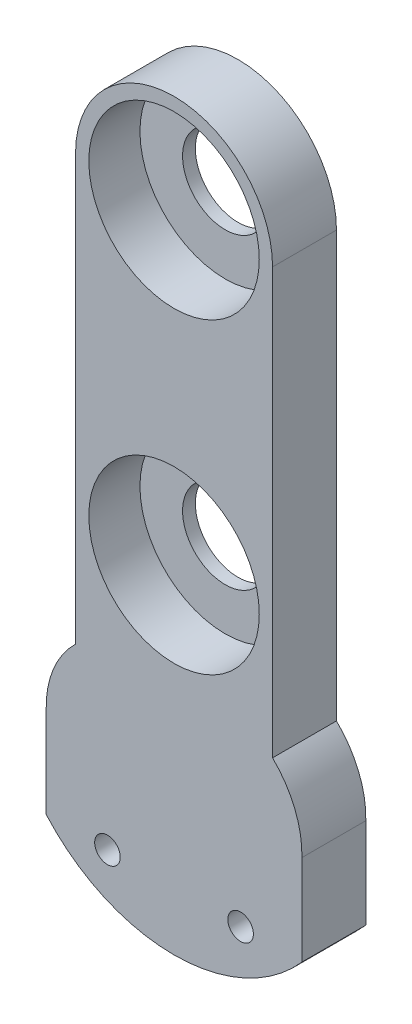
ISO-10303-21;
HEADER;
FILE_DESCRIPTION(('STEP AP214'),'2;1');
FILE_NAME('part.step','',(''),(''),'','','');
FILE_SCHEMA(('AUTOMOTIVE_DESIGN { 1 0 10303 214 1 1 1 1 }'));
ENDSEC;
DATA;
#1=APPLICATION_CONTEXT('core data for automotive mechanical design processes');
#2=APPLICATION_PROTOCOL_DEFINITION('international standard','automotive_design',2000,#1);
#3=PRODUCT_CONTEXT('',#1,'mechanical');
#4=PRODUCT('Part','Part','',(#3));
#5=PRODUCT_RELATED_PRODUCT_CATEGORY('part','',(#4));
#6=PRODUCT_DEFINITION_FORMATION('','',#4);
#7=PRODUCT_DEFINITION_CONTEXT('part definition',#1,'design');
#8=PRODUCT_DEFINITION('design','',#6,#7);
#9=PRODUCT_DEFINITION_SHAPE('','',#8);
#10=(LENGTH_UNIT() NAMED_UNIT(*) SI_UNIT(.MILLI.,.METRE.));
#11=(NAMED_UNIT(*) PLANE_ANGLE_UNIT() SI_UNIT($,.RADIAN.));
#12=(NAMED_UNIT(*) SI_UNIT($,.STERADIAN.) SOLID_ANGLE_UNIT());
#13=UNCERTAINTY_MEASURE_WITH_UNIT(LENGTH_MEASURE(1.E-05),#10,'distance_accuracy_value','');
#14=(GEOMETRIC_REPRESENTATION_CONTEXT(3) GLOBAL_UNCERTAINTY_ASSIGNED_CONTEXT((#13)) GLOBAL_UNIT_ASSIGNED_CONTEXT((#10,
#11,#12)) REPRESENTATION_CONTEXT('',''));
#15=CARTESIAN_POINT('',(0.,0.,0.));
#16=DIRECTION('',(0.,0.,1.));
#17=DIRECTION('',(1.,0.,0.));
#18=AXIS2_PLACEMENT_3D('',#15,#16,#17);
#19=CARTESIAN_POINT('',(22.6350916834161,21.7990207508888,15.));
#20=DIRECTION('',(0.,0.,-1.));
#21=DIRECTION('',(-1.,0.,0.));
#22=AXIS2_PLACEMENT_3D('',#19,#20,#21);
#23=PLANE('',#22);
#24=CARTESIAN_POINT('',(30.,137.820795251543,15.));
#25=DIRECTION('',(0.,0.,1.));
#26=DIRECTION('',(1.,0.,0.));
#27=AXIS2_PLACEMENT_3D('',#24,#25,#26);
#28=CIRCLE('',#27,20.);
#29=CARTESIAN_POINT('',(50.,137.820795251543,15.));
#30=VERTEX_POINT('',#29);
#31=EDGE_CURVE('E279',#30,#30,#28,.T.);
#32=ORIENTED_EDGE('',*,*,#31,.F.);
#33=EDGE_LOOP('',(#32));
#34=FACE_BOUND('',#33,.T.);
#35=CARTESIAN_POINT('',(30.,65.7007952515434,15.));
#36=DIRECTION('',(0.,0.,1.));
#37=DIRECTION('',(1.,0.,0.));
#38=AXIS2_PLACEMENT_3D('',#35,#36,#37);
#39=CIRCLE('',#38,20.);
#40=CARTESIAN_POINT('',(50.,65.7007952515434,15.));
#41=VERTEX_POINT('',#40);
#42=EDGE_CURVE('E283',#41,#41,#39,.T.);
#43=ORIENTED_EDGE('',*,*,#42,.F.);
#44=EDGE_LOOP('',(#43));
#45=FACE_BOUND('',#44,.T.);
#46=CARTESIAN_POINT('',(45.625,0.,15.));
#47=DIRECTION('',(0.,0.,-1.));
#48=DIRECTION('',(-1.,0.,0.));
#49=AXIS2_PLACEMENT_3D('',#46,#47,#48);
#50=CIRCLE('',#49,3.);
#51=CARTESIAN_POINT('',(42.625,0.,15.));
#52=VERTEX_POINT('',#51);
#53=EDGE_CURVE('E290',#52,#52,#50,.T.);
#54=ORIENTED_EDGE('',*,*,#53,.T.);
#55=EDGE_LOOP('',(#54));
#56=FACE_BOUND('',#55,.T.);
#57=DIRECTION('',(0.,-1.,0.));
#58=VECTOR('',#57,1.);
#59=CARTESIAN_POINT('',(6.88547195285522,137.820795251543,15.));
#60=LINE('',#59,#58);
#61=CARTESIAN_POINT('',(6.88547195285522,137.820795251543,15.));
#62=VERTEX_POINT('',#61);
#63=CARTESIAN_POINT('',(6.88547195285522,38.0660252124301,15.));
#64=VERTEX_POINT('',#63);
#65=EDGE_CURVE('E172',#62,#64,#60,.T.);
#66=ORIENTED_EDGE('',*,*,#65,.T.);
#67=CARTESIAN_POINT('',(22.6350916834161,21.7990207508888,15.));
#68=DIRECTION('',(0.,0.,-1.));
#69=DIRECTION('',(-1.,0.,0.));
#70=AXIS2_PLACEMENT_3D('',#67,#68,#69);
#71=CIRCLE('',#70,22.642127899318);
#72=CARTESIAN_POINT('',(0.,21.2345915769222,15.));
#73=VERTEX_POINT('',#72);
#74=EDGE_CURVE('E306',#73,#64,#71,.T.);
#75=ORIENTED_EDGE('',*,*,#74,.F.);
#76=DIRECTION('',(0.,1.,0.));
#77=VECTOR('',#76,1.);
#78=CARTESIAN_POINT('',(0.,0.,15.));
#79=LINE('',#78,#77);
#80=CARTESIAN_POINT('',(0.,0.,15.));
#81=VERTEX_POINT('',#80);
#82=EDGE_CURVE('E310',#81,#73,#79,.T.);
#83=ORIENTED_EDGE('',*,*,#82,.F.);
#84=CARTESIAN_POINT('',(30.,26.4575131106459,15.));
#85=DIRECTION('',(0.,0.,1.));
#86=DIRECTION('',(1.,0.,0.));
#87=AXIS2_PLACEMENT_3D('',#84,#85,#86);
#88=CIRCLE('',#87,40.);
#89=CARTESIAN_POINT('',(60.,0.,15.));
#90=VERTEX_POINT('',#89);
#91=EDGE_CURVE('E314',#81,#90,#88,.T.);
#92=ORIENTED_EDGE('',*,*,#91,.T.);
#93=DIRECTION('',(0.,1.,0.));
#94=VECTOR('',#93,1.);
#95=CARTESIAN_POINT('',(60.,0.,15.));
#96=LINE('',#95,#94);
#97=CARTESIAN_POINT('',(60.,21.2345915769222,15.));
#98=VERTEX_POINT('',#97);
#99=EDGE_CURVE('E193',#90,#98,#96,.T.);
#100=ORIENTED_EDGE('',*,*,#99,.T.);
#101=CARTESIAN_POINT('',(37.364908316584,21.7990207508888,15.));
#102=DIRECTION('',(0.,0.,1.));
#103=DIRECTION('',(1.,0.,0.));
#104=AXIS2_PLACEMENT_3D('',#101,#102,#103);
#105=CIRCLE('',#104,22.642127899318);
#106=CARTESIAN_POINT('',(53.1145280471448,38.0660252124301,15.));
#107=VERTEX_POINT('',#106);
#108=EDGE_CURVE('E187',#98,#107,#105,.T.);
#109=ORIENTED_EDGE('',*,*,#108,.T.);
#110=DIRECTION('',(0.,1.,0.));
#111=VECTOR('',#110,1.);
#112=CARTESIAN_POINT('',(53.1145280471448,38.0660252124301,15.));
#113=LINE('',#112,#111);
#114=CARTESIAN_POINT('',(53.1145280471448,137.820795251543,15.));
#115=VERTEX_POINT('',#114);
#116=EDGE_CURVE('E191',#107,#115,#113,.T.);
#117=ORIENTED_EDGE('',*,*,#116,.T.);
#118=CARTESIAN_POINT('',(30.,137.820795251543,15.));
#119=DIRECTION('',(0.,0.,-1.));
#120=DIRECTION('',(-1.,0.,0.));
#121=AXIS2_PLACEMENT_3D('',#118,#119,#120);
#122=CIRCLE('',#121,23.1145280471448);
#123=EDGE_CURVE('E211',#62,#115,#122,.T.);
#124=ORIENTED_EDGE('',*,*,#123,.F.);
#125=EDGE_LOOP('',(#66,#75,#83,#92,#100,#109,#117,#124));
#126=FACE_BOUND('',#125,.T.);
#127=CARTESIAN_POINT('',(14.375,0.,15.));
#128=DIRECTION('',(0.,0.,1.));
#129=DIRECTION('',(1.,0.,0.));
#130=AXIS2_PLACEMENT_3D('',#127,#128,#129);
#131=CIRCLE('',#130,3.);
#132=CARTESIAN_POINT('',(17.375,0.,15.));
#133=VERTEX_POINT('',#132);
#134=EDGE_CURVE('E220',#133,#133,#131,.T.);
#135=ORIENTED_EDGE('',*,*,#134,.F.);
#136=EDGE_LOOP('',(#135));
#137=FACE_BOUND('',#136,.T.);
#138=ADVANCED_FACE('F111',(#34,#45,#56,#126,#137),#23,.F.);
#139=CARTESIAN_POINT('',(22.6350916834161,21.7990207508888,0.));
#140=DIRECTION('',(0.,0.,-1.));
#141=DIRECTION('',(-1.,0.,0.));
#142=AXIS2_PLACEMENT_3D('',#139,#140,#141);
#143=PLANE('',#142);
#144=CARTESIAN_POINT('',(30.,137.820795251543,0.));
#145=DIRECTION('',(0.,0.,1.));
#146=DIRECTION('',(1.,0.,0.));
#147=AXIS2_PLACEMENT_3D('',#144,#145,#146);
#148=CIRCLE('',#147,10.);
#149=CARTESIAN_POINT('',(40.,137.820795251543,0.));
#150=VERTEX_POINT('',#149);
#151=EDGE_CURVE('E258',#150,#150,#148,.T.);
#152=ORIENTED_EDGE('',*,*,#151,.T.);
#153=EDGE_LOOP('',(#152));
#154=FACE_BOUND('',#153,.T.);
#155=CARTESIAN_POINT('',(30.,65.7007952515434,0.));
#156=DIRECTION('',(0.,0.,1.));
#157=DIRECTION('',(1.,0.,0.));
#158=AXIS2_PLACEMENT_3D('',#155,#156,#157);
#159=CIRCLE('',#158,10.);
#160=CARTESIAN_POINT('',(40.,65.7007952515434,0.));
#161=VERTEX_POINT('',#160);
#162=EDGE_CURVE('E266',#161,#161,#159,.T.);
#163=ORIENTED_EDGE('',*,*,#162,.T.);
#164=EDGE_LOOP('',(#163));
#165=FACE_BOUND('',#164,.T.);
#166=CARTESIAN_POINT('',(45.625,0.,0.));
#167=DIRECTION('',(0.,0.,-1.));
#168=DIRECTION('',(-1.,0.,0.));
#169=AXIS2_PLACEMENT_3D('',#166,#167,#168);
#170=CIRCLE('',#169,3.);
#171=CARTESIAN_POINT('',(42.625,0.,0.));
#172=VERTEX_POINT('',#171);
#173=EDGE_CURVE('E278',#172,#172,#170,.T.);
#174=ORIENTED_EDGE('',*,*,#173,.F.);
#175=EDGE_LOOP('',(#174));
#176=FACE_BOUND('',#175,.T.);
#177=DIRECTION('',(0.,-1.,0.));
#178=VECTOR('',#177,1.);
#179=CARTESIAN_POINT('',(6.88547195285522,115.557729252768,0.));
#180=LINE('',#179,#178);
#181=CARTESIAN_POINT('',(6.88547195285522,137.820795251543,0.));
#182=VERTEX_POINT('',#181);
#183=CARTESIAN_POINT('',(6.88547195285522,38.0660252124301,0.));
#184=VERTEX_POINT('',#183);
#185=EDGE_CURVE('E165',#182,#184,#180,.T.);
#186=ORIENTED_EDGE('',*,*,#185,.F.);
#187=CARTESIAN_POINT('',(30.,137.820795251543,0.));
#188=DIRECTION('',(0.,0.,-1.));
#189=DIRECTION('',(-1.,0.,0.));
#190=AXIS2_PLACEMENT_3D('',#187,#188,#189);
#191=CIRCLE('',#190,23.1145280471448);
#192=CARTESIAN_POINT('',(53.1145280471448,137.820795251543,0.));
#193=VERTEX_POINT('',#192);
#194=EDGE_CURVE('E238',#182,#193,#191,.T.);
#195=ORIENTED_EDGE('',*,*,#194,.T.);
#196=DIRECTION('',(0.,1.,0.));
#197=VECTOR('',#196,1.);
#198=CARTESIAN_POINT('',(53.1145280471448,115.557729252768,0.));
#199=LINE('',#198,#197);
#200=CARTESIAN_POINT('',(53.1145280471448,38.0660252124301,0.));
#201=VERTEX_POINT('',#200);
#202=EDGE_CURVE('E235',#201,#193,#199,.T.);
#203=ORIENTED_EDGE('',*,*,#202,.F.);
#204=CARTESIAN_POINT('',(37.364908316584,21.7990207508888,0.));
#205=DIRECTION('',(0.,0.,1.));
#206=DIRECTION('',(1.,0.,0.));
#207=AXIS2_PLACEMENT_3D('',#204,#205,#206);
#208=CIRCLE('',#207,22.642127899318);
#209=CARTESIAN_POINT('',(60.,21.2345915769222,0.));
#210=VERTEX_POINT('',#209);
#211=EDGE_CURVE('E204',#210,#201,#208,.T.);
#212=ORIENTED_EDGE('',*,*,#211,.F.);
#213=DIRECTION('',(0.,1.,0.));
#214=VECTOR('',#213,1.);
#215=CARTESIAN_POINT('',(60.,0.,0.));
#216=LINE('',#215,#214);
#217=CARTESIAN_POINT('',(60.,0.,0.));
#218=VERTEX_POINT('',#217);
#219=EDGE_CURVE('E230',#218,#210,#216,.T.);
#220=ORIENTED_EDGE('',*,*,#219,.F.);
#221=CARTESIAN_POINT('',(30.,26.4575131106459,0.));
#222=DIRECTION('',(0.,0.,1.));
#223=DIRECTION('',(1.,0.,0.));
#224=AXIS2_PLACEMENT_3D('',#221,#222,#223);
#225=CIRCLE('',#224,40.);
#226=CARTESIAN_POINT('',(0.,0.,0.));
#227=VERTEX_POINT('',#226);
#228=EDGE_CURVE('E227',#227,#218,#225,.T.);
#229=ORIENTED_EDGE('',*,*,#228,.F.);
#230=DIRECTION('',(0.,1.,0.));
#231=VECTOR('',#230,1.);
#232=CARTESIAN_POINT('',(0.,0.,0.));
#233=LINE('',#232,#231);
#234=CARTESIAN_POINT('',(0.,21.2345915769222,0.));
#235=VERTEX_POINT('',#234);
#236=EDGE_CURVE('E223',#227,#235,#233,.T.);
#237=ORIENTED_EDGE('',*,*,#236,.T.);
#238=CARTESIAN_POINT('',(22.6350916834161,21.7990207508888,0.));
#239=DIRECTION('',(0.,0.,-1.));
#240=DIRECTION('',(-1.,0.,0.));
#241=AXIS2_PLACEMENT_3D('',#238,#239,#240);
#242=CIRCLE('',#241,22.642127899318);
#243=EDGE_CURVE('E219',#235,#184,#242,.T.);
#244=ORIENTED_EDGE('',*,*,#243,.T.);
#245=EDGE_LOOP('',(#186,#195,#203,#212,#220,#229,#237,#244));
#246=FACE_BOUND('',#245,.T.);
#247=CARTESIAN_POINT('',(14.375,0.,0.));
#248=DIRECTION('',(0.,0.,1.));
#249=DIRECTION('',(1.,0.,0.));
#250=AXIS2_PLACEMENT_3D('',#247,#248,#249);
#251=CIRCLE('',#250,3.);
#252=CARTESIAN_POINT('',(17.375,0.,0.));
#253=VERTEX_POINT('',#252);
#254=EDGE_CURVE('E294',#253,#253,#251,.T.);
#255=ORIENTED_EDGE('',*,*,#254,.T.);
#256=EDGE_LOOP('',(#255));
#257=FACE_BOUND('',#256,.T.);
#258=ADVANCED_FACE('F326',(#154,#165,#176,#246,#257),#143,.T.);
#259=CARTESIAN_POINT('',(6.88547195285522,115.557729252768,15.));
#260=DIRECTION('',(1.,0.,0.));
#261=DIRECTION('',(0.,0.,-1.));
#262=AXIS2_PLACEMENT_3D('',#259,#260,#261);
#263=PLANE('',#262);
#264=ORIENTED_EDGE('',*,*,#185,.T.);
#265=DIRECTION('',(0.,0.,-1.));
#266=VECTOR('',#265,1.);
#267=CARTESIAN_POINT('',(6.88547195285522,38.0660252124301,15.));
#268=LINE('',#267,#266);
#269=EDGE_CURVE('E12',#64,#184,#268,.T.);
#270=ORIENTED_EDGE('',*,*,#269,.F.);
#271=ORIENTED_EDGE('',*,*,#65,.F.);
#272=DIRECTION('',(0.,0.,-1.));
#273=VECTOR('',#272,1.);
#274=CARTESIAN_POINT('',(6.88547195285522,137.820795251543,15.));
#275=LINE('',#274,#273);
#276=EDGE_CURVE('E131',#62,#182,#275,.T.);
#277=ORIENTED_EDGE('',*,*,#276,.T.);
#278=EDGE_LOOP('',(#264,#270,#271,#277));
#279=FACE_BOUND('',#278,.T.);
#280=ADVANCED_FACE('F113',(#279),#263,.F.);
#281=CARTESIAN_POINT('',(22.6350916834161,21.7990207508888,15.));
#282=DIRECTION('',(0.,0.,-1.));
#283=DIRECTION('',(-1.,0.,0.));
#284=AXIS2_PLACEMENT_3D('',#281,#282,#283);
#285=CYLINDRICAL_SURFACE('',#284,22.642127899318);
#286=ORIENTED_EDGE('',*,*,#243,.F.);
#287=DIRECTION('',(0.,0.,-1.));
#288=VECTOR('',#287,1.);
#289=CARTESIAN_POINT('',(0.,21.2345915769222,15.));
#290=LINE('',#289,#288);
#291=EDGE_CURVE('E122',#73,#235,#290,.T.);
#292=ORIENTED_EDGE('',*,*,#291,.F.);
#293=ORIENTED_EDGE('',*,*,#74,.T.);
#294=ORIENTED_EDGE('',*,*,#269,.T.);
#295=EDGE_LOOP('',(#286,#292,#293,#294));
#296=FACE_BOUND('',#295,.T.);
#297=ADVANCED_FACE('F456',(#296),#285,.T.);
#298=CARTESIAN_POINT('',(0.,0.,15.));
#299=DIRECTION('',(-1.,0.,0.));
#300=DIRECTION('',(0.,-1.,0.));
#301=AXIS2_PLACEMENT_3D('',#298,#299,#300);
#302=PLANE('',#301);
#303=ORIENTED_EDGE('',*,*,#236,.F.);
#304=DIRECTION('',(0.,0.,-1.));
#305=VECTOR('',#304,1.);
#306=CARTESIAN_POINT('',(0.,0.,15.));
#307=LINE('',#306,#305);
#308=EDGE_CURVE('E251',#81,#227,#307,.T.);
#309=ORIENTED_EDGE('',*,*,#308,.F.);
#310=ORIENTED_EDGE('',*,*,#82,.T.);
#311=ORIENTED_EDGE('',*,*,#291,.T.);
#312=EDGE_LOOP('',(#303,#309,#310,#311));
#313=FACE_BOUND('',#312,.T.);
#314=ADVANCED_FACE('F448',(#313),#302,.T.);
#315=CARTESIAN_POINT('',(30.,26.4575131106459,15.));
#316=DIRECTION('',(0.,0.,-1.));
#317=DIRECTION('',(-1.,0.,0.));
#318=AXIS2_PLACEMENT_3D('',#315,#316,#317);
#319=CYLINDRICAL_SURFACE('',#318,40.);
#320=ORIENTED_EDGE('',*,*,#228,.T.);
#321=DIRECTION('',(0.,0.,-1.));
#322=VECTOR('',#321,1.);
#323=CARTESIAN_POINT('',(60.,0.,15.));
#324=LINE('',#323,#322);
#325=EDGE_CURVE('E247',#90,#218,#324,.T.);
#326=ORIENTED_EDGE('',*,*,#325,.F.);
#327=ORIENTED_EDGE('',*,*,#91,.F.);
#328=ORIENTED_EDGE('',*,*,#308,.T.);
#329=EDGE_LOOP('',(#320,#326,#327,#328));
#330=FACE_BOUND('',#329,.T.);
#331=ADVANCED_FACE('F321',(#330),#319,.T.);
#332=CARTESIAN_POINT('',(60.,0.,15.));
#333=DIRECTION('',(-1.,0.,0.));
#334=DIRECTION('',(0.,0.,1.));
#335=AXIS2_PLACEMENT_3D('',#332,#333,#334);
#336=PLANE('',#335);
#337=ORIENTED_EDGE('',*,*,#219,.T.);
#338=DIRECTION('',(0.,0.,-1.));
#339=VECTOR('',#338,1.);
#340=CARTESIAN_POINT('',(60.,21.2345915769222,15.));
#341=LINE('',#340,#339);
#342=EDGE_CURVE('E207',#98,#210,#341,.T.);
#343=ORIENTED_EDGE('',*,*,#342,.F.);
#344=ORIENTED_EDGE('',*,*,#99,.F.);
#345=ORIENTED_EDGE('',*,*,#325,.T.);
#346=EDGE_LOOP('',(#337,#343,#344,#345));
#347=FACE_BOUND('',#346,.T.);
#348=ADVANCED_FACE('F325',(#347),#336,.F.);
#349=CARTESIAN_POINT('',(37.364908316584,21.7990207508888,15.));
#350=DIRECTION('',(0.,0.,-1.));
#351=DIRECTION('',(-1.,0.,0.));
#352=AXIS2_PLACEMENT_3D('',#349,#350,#351);
#353=CYLINDRICAL_SURFACE('',#352,22.642127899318);
#354=ORIENTED_EDGE('',*,*,#211,.T.);
#355=DIRECTION('',(0.,0.,-1.));
#356=VECTOR('',#355,1.);
#357=CARTESIAN_POINT('',(53.1145280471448,38.0660252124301,15.));
#358=LINE('',#357,#356);
#359=EDGE_CURVE('E201',#107,#201,#358,.T.);
#360=ORIENTED_EDGE('',*,*,#359,.F.);
#361=ORIENTED_EDGE('',*,*,#108,.F.);
#362=ORIENTED_EDGE('',*,*,#342,.T.);
#363=EDGE_LOOP('',(#354,#360,#361,#362));
#364=FACE_BOUND('',#363,.T.);
#365=ADVANCED_FACE('F202',(#364),#353,.T.);
#366=CARTESIAN_POINT('',(53.1145280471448,115.557729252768,15.));
#367=DIRECTION('',(-1.,0.,0.));
#368=DIRECTION('',(0.,0.,1.));
#369=AXIS2_PLACEMENT_3D('',#366,#367,#368);
#370=PLANE('',#369);
#371=ORIENTED_EDGE('',*,*,#202,.T.);
#372=DIRECTION('',(0.,0.,-1.));
#373=VECTOR('',#372,1.);
#374=CARTESIAN_POINT('',(53.1145280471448,137.820795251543,15.));
#375=LINE('',#374,#373);
#376=EDGE_CURVE('E157',#115,#193,#375,.T.);
#377=ORIENTED_EDGE('',*,*,#376,.F.);
#378=ORIENTED_EDGE('',*,*,#116,.F.);
#379=ORIENTED_EDGE('',*,*,#359,.T.);
#380=EDGE_LOOP('',(#371,#377,#378,#379));
#381=FACE_BOUND('',#380,.T.);
#382=ADVANCED_FACE('F209',(#381),#370,.F.);
#383=CARTESIAN_POINT('',(30.,137.820795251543,15.));
#384=DIRECTION('',(0.,0.,-1.));
#385=DIRECTION('',(-1.,0.,0.));
#386=AXIS2_PLACEMENT_3D('',#383,#384,#385);
#387=CYLINDRICAL_SURFACE('',#386,23.1145280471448);
#388=ORIENTED_EDGE('',*,*,#194,.F.);
#389=ORIENTED_EDGE('',*,*,#276,.F.);
#390=ORIENTED_EDGE('',*,*,#123,.T.);
#391=ORIENTED_EDGE('',*,*,#376,.T.);
#392=EDGE_LOOP('',(#388,#389,#390,#391));
#393=FACE_BOUND('',#392,.T.);
#394=ADVANCED_FACE('F328',(#393),#387,.T.);
#395=CARTESIAN_POINT('',(14.375,0.,15.));
#396=DIRECTION('',(0.,0.,-1.));
#397=DIRECTION('',(-1.,0.,0.));
#398=AXIS2_PLACEMENT_3D('',#395,#396,#397);
#399=CYLINDRICAL_SURFACE('',#398,3.);
#400=ORIENTED_EDGE('',*,*,#134,.T.);
#401=EDGE_LOOP('',(#400));
#402=FACE_BOUND('',#401,.T.);
#403=ORIENTED_EDGE('',*,*,#254,.F.);
#404=EDGE_LOOP('',(#403));
#405=FACE_BOUND('',#404,.T.);
#406=ADVANCED_FACE('F330',(#402,#405),#399,.F.);
#407=CARTESIAN_POINT('',(45.625,0.,15.));
#408=DIRECTION('',(0.,0.,-1.));
#409=DIRECTION('',(-1.,0.,0.));
#410=AXIS2_PLACEMENT_3D('',#407,#408,#409);
#411=CYLINDRICAL_SURFACE('',#410,3.);
#412=ORIENTED_EDGE('',*,*,#53,.F.);
#413=EDGE_LOOP('',(#412));
#414=FACE_BOUND('',#413,.T.);
#415=ORIENTED_EDGE('',*,*,#173,.T.);
#416=EDGE_LOOP('',(#415));
#417=FACE_BOUND('',#416,.T.);
#418=ADVANCED_FACE('F336',(#414,#417),#411,.F.);
#419=CARTESIAN_POINT('',(30.,65.7007952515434,3.));
#420=DIRECTION('',(0.,0.,1.));
#421=DIRECTION('',(1.,0.,0.));
#422=AXIS2_PLACEMENT_3D('',#419,#420,#421);
#423=CYLINDRICAL_SURFACE('',#422,20.);
#424=CARTESIAN_POINT('',(30.,65.7007952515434,3.));
#425=DIRECTION('',(0.,0.,1.));
#426=DIRECTION('',(1.,0.,0.));
#427=AXIS2_PLACEMENT_3D('',#424,#425,#426);
#428=CIRCLE('',#427,20.);
#429=CARTESIAN_POINT('',(50.,65.7007952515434,3.));
#430=VERTEX_POINT('',#429);
#431=EDGE_CURVE('E264',#430,#430,#428,.T.);
#432=ORIENTED_EDGE('',*,*,#431,.F.);
#433=EDGE_LOOP('',(#432));
#434=FACE_BOUND('',#433,.T.);
#435=ORIENTED_EDGE('',*,*,#42,.T.);
#436=EDGE_LOOP('',(#435));
#437=FACE_BOUND('',#436,.T.);
#438=ADVANCED_FACE('F353',(#434,#437),#423,.F.);
#439=CARTESIAN_POINT('',(30.,65.7007952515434,3.));
#440=DIRECTION('',(0.,0.,1.));
#441=DIRECTION('',(1.,0.,0.));
#442=AXIS2_PLACEMENT_3D('',#439,#440,#441);
#443=PLANE('',#442);
#444=CARTESIAN_POINT('',(30.,65.7007952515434,3.));
#445=DIRECTION('',(0.,0.,1.));
#446=DIRECTION('',(1.,0.,0.));
#447=AXIS2_PLACEMENT_3D('',#444,#445,#446);
#448=CIRCLE('',#447,10.);
#449=CARTESIAN_POINT('',(40.,65.7007952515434,3.));
#450=VERTEX_POINT('',#449);
#451=EDGE_CURVE('E115',#450,#450,#448,.T.);
#452=ORIENTED_EDGE('',*,*,#451,.F.);
#453=EDGE_LOOP('',(#452));
#454=FACE_BOUND('',#453,.T.);
#455=ORIENTED_EDGE('',*,*,#431,.T.);
#456=EDGE_LOOP('',(#455));
#457=FACE_BOUND('',#456,.T.);
#458=ADVANCED_FACE('F355',(#454,#457),#443,.T.);
#459=CARTESIAN_POINT('',(30.,137.820795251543,3.));
#460=DIRECTION('',(0.,0.,1.));
#461=DIRECTION('',(1.,0.,0.));
#462=AXIS2_PLACEMENT_3D('',#459,#460,#461);
#463=CYLINDRICAL_SURFACE('',#462,20.);
#464=CARTESIAN_POINT('',(30.,137.820795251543,3.));
#465=DIRECTION('',(0.,0.,1.));
#466=DIRECTION('',(1.,0.,0.));
#467=AXIS2_PLACEMENT_3D('',#464,#465,#466);
#468=CIRCLE('',#467,20.);
#469=CARTESIAN_POINT('',(50.,137.820795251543,3.));
#470=VERTEX_POINT('',#469);
#471=EDGE_CURVE('E274',#470,#470,#468,.T.);
#472=ORIENTED_EDGE('',*,*,#471,.F.);
#473=EDGE_LOOP('',(#472));
#474=FACE_BOUND('',#473,.T.);
#475=ORIENTED_EDGE('',*,*,#31,.T.);
#476=EDGE_LOOP('',(#475));
#477=FACE_BOUND('',#476,.T.);
#478=ADVANCED_FACE('F358',(#474,#477),#463,.F.);
#479=CARTESIAN_POINT('',(30.,137.820795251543,3.));
#480=DIRECTION('',(0.,0.,1.));
#481=DIRECTION('',(1.,0.,0.));
#482=AXIS2_PLACEMENT_3D('',#479,#480,#481);
#483=PLANE('',#482);
#484=CARTESIAN_POINT('',(30.,137.820795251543,3.));
#485=DIRECTION('',(0.,0.,1.));
#486=DIRECTION('',(1.,0.,0.));
#487=AXIS2_PLACEMENT_3D('',#484,#485,#486);
#488=CIRCLE('',#487,10.);
#489=CARTESIAN_POINT('',(40.,137.820795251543,3.));
#490=VERTEX_POINT('',#489);
#491=EDGE_CURVE('E255',#490,#490,#488,.T.);
#492=ORIENTED_EDGE('',*,*,#491,.F.);
#493=EDGE_LOOP('',(#492));
#494=FACE_BOUND('',#493,.T.);
#495=ORIENTED_EDGE('',*,*,#471,.T.);
#496=EDGE_LOOP('',(#495));
#497=FACE_BOUND('',#496,.T.);
#498=ADVANCED_FACE('F364',(#494,#497),#483,.T.);
#499=CARTESIAN_POINT('',(30.,137.820795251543,0.));
#500=DIRECTION('',(0.,0.,1.));
#501=DIRECTION('',(1.,0.,0.));
#502=AXIS2_PLACEMENT_3D('',#499,#500,#501);
#503=CYLINDRICAL_SURFACE('',#502,10.);
#504=ORIENTED_EDGE('',*,*,#491,.T.);
#505=EDGE_LOOP('',(#504));
#506=FACE_BOUND('',#505,.T.);
#507=ORIENTED_EDGE('',*,*,#151,.F.);
#508=EDGE_LOOP('',(#507));
#509=FACE_BOUND('',#508,.T.);
#510=ADVANCED_FACE('F368',(#506,#509),#503,.F.);
#511=CARTESIAN_POINT('',(30.,65.7007952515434,0.));
#512=DIRECTION('',(0.,0.,1.));
#513=DIRECTION('',(1.,0.,0.));
#514=AXIS2_PLACEMENT_3D('',#511,#512,#513);
#515=CYLINDRICAL_SURFACE('',#514,10.);
#516=ORIENTED_EDGE('',*,*,#451,.T.);
#517=EDGE_LOOP('',(#516));
#518=FACE_BOUND('',#517,.T.);
#519=ORIENTED_EDGE('',*,*,#162,.F.);
#520=EDGE_LOOP('',(#519));
#521=FACE_BOUND('',#520,.T.);
#522=ADVANCED_FACE('F370',(#518,#521),#515,.F.);
#523=CLOSED_SHELL('',(#138,#258,#280,#297,#314,#331,#348,#365,#382,#394,#406,#418,#438,#458,
#478,#498,#510,#522));
#524=MANIFOLD_SOLID_BREP('B2',#523);
#525=ADVANCED_BREP_SHAPE_REPRESENTATION('',(#18,#524),#14);
#526=SHAPE_DEFINITION_REPRESENTATION(#9,#525);
ENDSEC;
END-ISO-10303-21;
